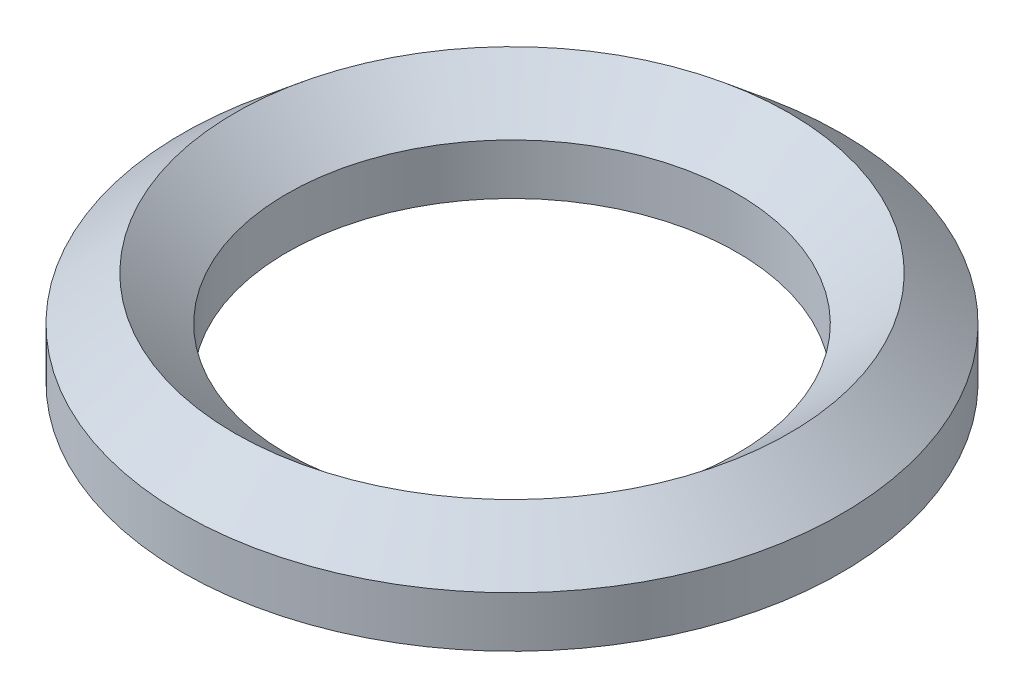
ISO-10303-21;
HEADER;
FILE_DESCRIPTION(('STEP AP214'),'2;1');
FILE_NAME('part.step','',(''),(''),'','','');
FILE_SCHEMA(('AUTOMOTIVE_DESIGN { 1 0 10303 214 1 1 1 1 }'));
ENDSEC;
DATA;
#1=APPLICATION_CONTEXT('core data for automotive mechanical design processes');
#2=APPLICATION_PROTOCOL_DEFINITION('international standard','automotive_design',2000,#1);
#3=PRODUCT_CONTEXT('',#1,'mechanical');
#4=PRODUCT('Part','Part','',(#3));
#5=PRODUCT_RELATED_PRODUCT_CATEGORY('part','',(#4));
#6=PRODUCT_DEFINITION_FORMATION('','',#4);
#7=PRODUCT_DEFINITION_CONTEXT('part definition',#1,'design');
#8=PRODUCT_DEFINITION('design','',#6,#7);
#9=PRODUCT_DEFINITION_SHAPE('','',#8);
#10=(LENGTH_UNIT() NAMED_UNIT(*) SI_UNIT(.MILLI.,.METRE.));
#11=(NAMED_UNIT(*) PLANE_ANGLE_UNIT() SI_UNIT($,.RADIAN.));
#12=(NAMED_UNIT(*) SI_UNIT($,.STERADIAN.) SOLID_ANGLE_UNIT());
#13=UNCERTAINTY_MEASURE_WITH_UNIT(LENGTH_MEASURE(1.E-05),#10,'distance_accuracy_value','');
#14=(GEOMETRIC_REPRESENTATION_CONTEXT(3) GLOBAL_UNCERTAINTY_ASSIGNED_CONTEXT((#13)) GLOBAL_UNIT_ASSIGNED_CONTEXT((#10,
#11,#12)) REPRESENTATION_CONTEXT('',''));
#15=CARTESIAN_POINT('',(0.,0.,0.));
#16=DIRECTION('',(0.,0.,1.));
#17=DIRECTION('',(1.,0.,0.));
#18=AXIS2_PLACEMENT_3D('',#15,#16,#17);
#19=CARTESIAN_POINT('',(0.,2.56556332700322,0.));
#20=DIRECTION('',(0.,1.,0.));
#21=DIRECTION('',(0.,0.,1.));
#22=AXIS2_PLACEMENT_3D('',#19,#20,#21);
#23=CYLINDRICAL_SURFACE('',#22,16.25);
#24=CARTESIAN_POINT('',(0.,-2.16068155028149,0.));
#25=DIRECTION('',(0.,1.,0.));
#26=DIRECTION('',(0.,0.,1.));
#27=AXIS2_PLACEMENT_3D('',#24,#25,#26);
#28=CIRCLE('',#27,16.25);
#29=CARTESIAN_POINT('',(0.,-2.16068155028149,16.25));
#30=VERTEX_POINT('',#29);
#31=EDGE_CURVE('E10',#30,#30,#28,.T.);
#32=ORIENTED_EDGE('',*,*,#31,.F.);
#33=EDGE_LOOP('',(#32));
#34=FACE_BOUND('',#33,.T.);
#35=CARTESIAN_POINT('',(0.,-4.66068155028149,0.));
#36=DIRECTION('',(0.,1.,0.));
#37=DIRECTION('',(0.,0.,1.));
#38=AXIS2_PLACEMENT_3D('',#35,#36,#37);
#39=CIRCLE('',#38,16.25);
#40=CARTESIAN_POINT('',(0.,-4.66068155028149,16.25));
#41=VERTEX_POINT('',#40);
#42=EDGE_CURVE('E50',#41,#41,#39,.T.);
#43=ORIENTED_EDGE('',*,*,#42,.T.);
#44=EDGE_LOOP('',(#43));
#45=FACE_BOUND('',#44,.T.);
#46=ADVANCED_FACE('F31',(#34,#45),#23,.T.);
#47=CARTESIAN_POINT('',(0.,-2.16068155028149,0.));
#48=DIRECTION('',(0.,-1.,0.));
#49=DIRECTION('',(0.,0.,-1.));
#50=AXIS2_PLACEMENT_3D('',#47,#48,#49);
#51=CONICAL_SURFACE('',#50,16.25,0.872664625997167);
#52=CARTESIAN_POINT('',(0.,0.,0.));
#53=DIRECTION('',(0.,1.,0.));
#54=DIRECTION('',(0.,0.,1.));
#55=AXIS2_PLACEMENT_3D('',#52,#53,#54);
#56=CIRCLE('',#55,13.675);
#57=CARTESIAN_POINT('',(0.,0.,13.675));
#58=VERTEX_POINT('',#57);
#59=EDGE_CURVE('E37',#58,#58,#56,.T.);
#60=ORIENTED_EDGE('',*,*,#59,.F.);
#61=EDGE_LOOP('',(#60));
#62=FACE_BOUND('',#61,.T.);
#63=ORIENTED_EDGE('',*,*,#31,.T.);
#64=EDGE_LOOP('',(#63));
#65=FACE_BOUND('',#64,.T.);
#66=ADVANCED_FACE('F69',(#62,#65),#51,.T.);
#67=CARTESIAN_POINT('',(0.,0.,0.));
#68=DIRECTION('',(0.,1.,0.));
#69=DIRECTION('',(0.,0.,1.));
#70=AXIS2_PLACEMENT_3D('',#67,#68,#69);
#71=CONICAL_SURFACE('',#70,13.675,0.872664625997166);
#72=CARTESIAN_POINT('',(0.,-2.16068155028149,0.));
#73=DIRECTION('',(0.,1.,0.));
#74=DIRECTION('',(0.,0.,1.));
#75=AXIS2_PLACEMENT_3D('',#72,#73,#74);
#76=CIRCLE('',#75,11.1);
#77=CARTESIAN_POINT('',(0.,-2.16068155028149,11.1));
#78=VERTEX_POINT('',#77);
#79=EDGE_CURVE('E41',#78,#78,#76,.T.);
#80=ORIENTED_EDGE('',*,*,#79,.F.);
#81=EDGE_LOOP('',(#80));
#82=FACE_BOUND('',#81,.T.);
#83=ORIENTED_EDGE('',*,*,#59,.T.);
#84=EDGE_LOOP('',(#83));
#85=FACE_BOUND('',#84,.T.);
#86=ADVANCED_FACE('F64',(#82,#85),#71,.F.);
#87=CARTESIAN_POINT('',(0.,2.56556332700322,0.));
#88=DIRECTION('',(0.,1.,0.));
#89=DIRECTION('',(0.,0.,1.));
#90=AXIS2_PLACEMENT_3D('',#87,#88,#89);
#91=CYLINDRICAL_SURFACE('',#90,11.1);
#92=CARTESIAN_POINT('',(0.,-4.66068155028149,0.));
#93=DIRECTION('',(0.,1.,0.));
#94=DIRECTION('',(0.,0.,1.));
#95=AXIS2_PLACEMENT_3D('',#92,#93,#94);
#96=CIRCLE('',#95,11.1);
#97=CARTESIAN_POINT('',(0.,-4.66068155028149,11.1));
#98=VERTEX_POINT('',#97);
#99=EDGE_CURVE('E45',#98,#98,#96,.T.);
#100=ORIENTED_EDGE('',*,*,#99,.F.);
#101=EDGE_LOOP('',(#100));
#102=FACE_BOUND('',#101,.T.);
#103=ORIENTED_EDGE('',*,*,#79,.T.);
#104=EDGE_LOOP('',(#103));
#105=FACE_BOUND('',#104,.T.);
#106=ADVANCED_FACE('F58',(#102,#105),#91,.F.);
#107=CARTESIAN_POINT('',(0.,-4.66068155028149,-11.1));
#108=DIRECTION('',(0.,1.,0.));
#109=DIRECTION('',(0.,0.,1.));
#110=AXIS2_PLACEMENT_3D('',#107,#108,#109);
#111=PLANE('',#110);
#112=ORIENTED_EDGE('',*,*,#42,.F.);
#113=EDGE_LOOP('',(#112));
#114=FACE_BOUND('',#113,.T.);
#115=ORIENTED_EDGE('',*,*,#99,.T.);
#116=EDGE_LOOP('',(#115));
#117=FACE_BOUND('',#116,.T.);
#118=ADVANCED_FACE('F55',(#114,#117),#111,.F.);
#119=CLOSED_SHELL('',(#46,#66,#86,#106,#118));
#120=MANIFOLD_SOLID_BREP('B2',#119);
#121=ADVANCED_BREP_SHAPE_REPRESENTATION('',(#18,#120),#14);
#122=SHAPE_DEFINITION_REPRESENTATION(#9,#121);
ENDSEC;
END-ISO-10303-21;
